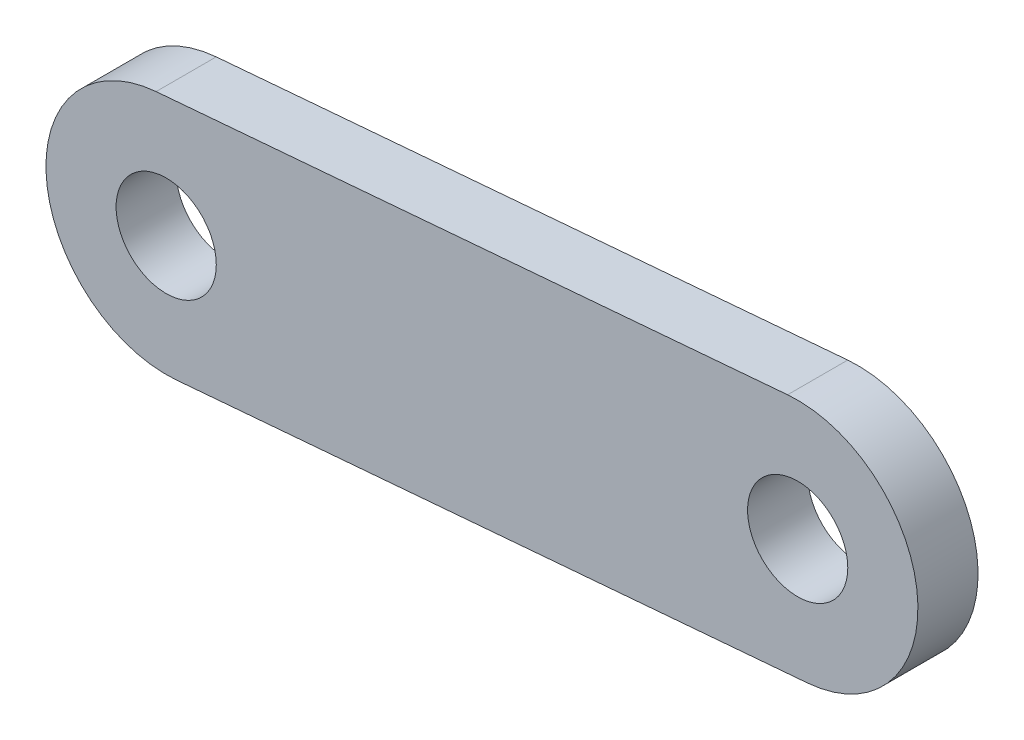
ISO-10303-21;
HEADER;
FILE_DESCRIPTION(('STEP AP214'),'2;1');
FILE_NAME('part.step','',(''),(''),'','','');
FILE_SCHEMA(('AUTOMOTIVE_DESIGN { 1 0 10303 214 1 1 1 1 }'));
ENDSEC;
DATA;
#1=APPLICATION_CONTEXT('core data for automotive mechanical design processes');
#2=APPLICATION_PROTOCOL_DEFINITION('international standard','automotive_design',2000,#1);
#3=PRODUCT_CONTEXT('',#1,'mechanical');
#4=PRODUCT('Part','Part','',(#3));
#5=PRODUCT_RELATED_PRODUCT_CATEGORY('part','',(#4));
#6=PRODUCT_DEFINITION_FORMATION('','',#4);
#7=PRODUCT_DEFINITION_CONTEXT('part definition',#1,'design');
#8=PRODUCT_DEFINITION('design','',#6,#7);
#9=PRODUCT_DEFINITION_SHAPE('','',#8);
#10=(LENGTH_UNIT() NAMED_UNIT(*) SI_UNIT(.MILLI.,.METRE.));
#11=(NAMED_UNIT(*) PLANE_ANGLE_UNIT() SI_UNIT($,.RADIAN.));
#12=(NAMED_UNIT(*) SI_UNIT($,.STERADIAN.) SOLID_ANGLE_UNIT());
#13=UNCERTAINTY_MEASURE_WITH_UNIT(LENGTH_MEASURE(1.E-05),#10,'distance_accuracy_value','');
#14=(GEOMETRIC_REPRESENTATION_CONTEXT(3) GLOBAL_UNCERTAINTY_ASSIGNED_CONTEXT((#13)) GLOBAL_UNIT_ASSIGNED_CONTEXT((#10,
#11,#12)) REPRESENTATION_CONTEXT('',''));
#15=CARTESIAN_POINT('',(0.,0.,0.));
#16=DIRECTION('',(0.,0.,1.));
#17=DIRECTION('',(1.,0.,0.));
#18=AXIS2_PLACEMENT_3D('',#15,#16,#17);
#19=CARTESIAN_POINT('',(-15.7012006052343,-2.65409804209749,1.5));
#20=DIRECTION('',(0.,0.,-1.));
#21=DIRECTION('',(-1.,0.,0.));
#22=AXIS2_PLACEMENT_3D('',#19,#20,#21);
#23=PLANE('',#22);
#24=CARTESIAN_POINT('',(-15.7012006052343,-2.65409804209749,1.5));
#25=DIRECTION('',(0.,0.,1.));
#26=DIRECTION('',(-1.,0.,0.));
#27=AXIS2_PLACEMENT_3D('',#24,#25,#26);
#28=CIRCLE('',#27,6.);
#29=CARTESIAN_POINT('',(-16.2047803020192,3.32473190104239,1.5));
#30=VERTEX_POINT('',#29);
#31=CARTESIAN_POINT('',(-15.1976209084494,-8.63292798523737,1.5));
#32=VERTEX_POINT('',#31);
#33=EDGE_CURVE('E86',#30,#32,#28,.T.);
#34=ORIENTED_EDGE('',*,*,#33,.T.);
#35=DIRECTION('',(0.99647165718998,0.0839299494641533,0.));
#36=VECTOR('',#35,1.);
#37=CARTESIAN_POINT('',(-15.1976209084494,-8.63292798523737,1.5));
#38=LINE('',#37,#36);
#39=CARTESIAN_POINT('',(16.3135796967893,-5.97882994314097,1.5));
#40=VERTEX_POINT('',#39);
#41=EDGE_CURVE('E81',#32,#40,#38,.T.);
#42=ORIENTED_EDGE('',*,*,#41,.T.);
#43=CARTESIAN_POINT('',(15.8100000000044,-1.08940634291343E-12,1.5));
#44=DIRECTION('',(0.,0.,1.));
#45=DIRECTION('',(1.,0.,0.));
#46=AXIS2_PLACEMENT_3D('',#43,#44,#45);
#47=CIRCLE('',#46,6.);
#48=CARTESIAN_POINT('',(15.3064203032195,5.97882994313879,1.5));
#49=VERTEX_POINT('',#48);
#50=EDGE_CURVE('E84',#40,#49,#47,.T.);
#51=ORIENTED_EDGE('',*,*,#50,.T.);
#52=DIRECTION('',(-0.99647165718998,-0.0839299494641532,0.));
#53=VECTOR('',#52,1.);
#54=CARTESIAN_POINT('',(15.3064203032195,5.97882994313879,1.5));
#55=LINE('',#54,#53);
#56=EDGE_CURVE('E51',#49,#30,#55,.T.);
#57=ORIENTED_EDGE('',*,*,#56,.T.);
#58=EDGE_LOOP('',(#34,#42,#51,#57));
#59=FACE_BOUND('',#58,.T.);
#60=CARTESIAN_POINT('',(15.8100000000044,-1.08940634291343E-12,1.5));
#61=DIRECTION('',(0.,0.,1.));
#62=DIRECTION('',(1.,0.,0.));
#63=AXIS2_PLACEMENT_3D('',#60,#61,#62);
#64=CIRCLE('',#63,2.5);
#65=CARTESIAN_POINT('',(18.3100000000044,-1.08940634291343E-12,1.5));
#66=VERTEX_POINT('',#65);
#67=EDGE_CURVE('E101',#66,#66,#64,.T.);
#68=ORIENTED_EDGE('',*,*,#67,.F.);
#69=EDGE_LOOP('',(#68));
#70=FACE_BOUND('',#69,.T.);
#71=CARTESIAN_POINT('',(-15.7012006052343,-2.65409804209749,1.5));
#72=DIRECTION('',(0.,0.,1.));
#73=DIRECTION('',(1.,0.,0.));
#74=AXIS2_PLACEMENT_3D('',#71,#72,#73);
#75=CIRCLE('',#74,2.5);
#76=CARTESIAN_POINT('',(-13.2012006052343,-2.65409804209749,1.5));
#77=VERTEX_POINT('',#76);
#78=EDGE_CURVE('E116',#77,#77,#75,.T.);
#79=ORIENTED_EDGE('',*,*,#78,.F.);
#80=EDGE_LOOP('',(#79));
#81=FACE_BOUND('',#80,.T.);
#82=ADVANCED_FACE('F34',(#59,#70,#81),#23,.F.);
#83=CARTESIAN_POINT('',(-15.7012006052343,-2.65409804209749,-1.5));
#84=DIRECTION('',(0.,0.,-1.));
#85=DIRECTION('',(-1.,0.,0.));
#86=AXIS2_PLACEMENT_3D('',#83,#84,#85);
#87=PLANE('',#86);
#88=CARTESIAN_POINT('',(15.8100000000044,-1.08940634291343E-12,-1.5));
#89=DIRECTION('',(0.,0.,1.));
#90=DIRECTION('',(1.,0.,0.));
#91=AXIS2_PLACEMENT_3D('',#88,#89,#90);
#92=CIRCLE('',#91,2.5);
#93=CARTESIAN_POINT('',(18.3100000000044,-1.08940634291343E-12,-1.5));
#94=VERTEX_POINT('',#93);
#95=EDGE_CURVE('E113',#94,#94,#92,.T.);
#96=ORIENTED_EDGE('',*,*,#95,.T.);
#97=EDGE_LOOP('',(#96));
#98=FACE_BOUND('',#97,.T.);
#99=CARTESIAN_POINT('',(-15.7012006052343,-2.65409804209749,-1.5));
#100=DIRECTION('',(0.,0.,1.));
#101=DIRECTION('',(-1.,0.,0.));
#102=AXIS2_PLACEMENT_3D('',#99,#100,#101);
#103=CIRCLE('',#102,6.);
#104=CARTESIAN_POINT('',(-16.2047803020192,3.32473190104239,-1.5));
#105=VERTEX_POINT('',#104);
#106=CARTESIAN_POINT('',(-15.1976209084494,-8.63292798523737,-1.5));
#107=VERTEX_POINT('',#106);
#108=EDGE_CURVE('E98',#105,#107,#103,.T.);
#109=ORIENTED_EDGE('',*,*,#108,.F.);
#110=DIRECTION('',(-0.99647165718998,-0.0839299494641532,0.));
#111=VECTOR('',#110,1.);
#112=CARTESIAN_POINT('',(15.3064203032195,5.97882994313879,-1.5));
#113=LINE('',#112,#111);
#114=CARTESIAN_POINT('',(15.3064203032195,5.97882994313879,-1.5));
#115=VERTEX_POINT('',#114);
#116=EDGE_CURVE('E74',#115,#105,#113,.T.);
#117=ORIENTED_EDGE('',*,*,#116,.F.);
#118=CARTESIAN_POINT('',(15.8100000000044,-1.08940634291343E-12,-1.5));
#119=DIRECTION('',(0.,0.,1.));
#120=DIRECTION('',(1.,0.,0.));
#121=AXIS2_PLACEMENT_3D('',#118,#119,#120);
#122=CIRCLE('',#121,6.);
#123=CARTESIAN_POINT('',(16.3135796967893,-5.97882994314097,-1.5));
#124=VERTEX_POINT('',#123);
#125=EDGE_CURVE('E68',#124,#115,#122,.T.);
#126=ORIENTED_EDGE('',*,*,#125,.F.);
#127=DIRECTION('',(0.99647165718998,0.0839299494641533,0.));
#128=VECTOR('',#127,1.);
#129=CARTESIAN_POINT('',(-15.1976209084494,-8.63292798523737,-1.5));
#130=LINE('',#129,#128);
#131=EDGE_CURVE('E90',#107,#124,#130,.T.);
#132=ORIENTED_EDGE('',*,*,#131,.F.);
#133=EDGE_LOOP('',(#109,#117,#126,#132));
#134=FACE_BOUND('',#133,.T.);
#135=CARTESIAN_POINT('',(-15.7012006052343,-2.65409804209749,-1.5));
#136=DIRECTION('',(0.,0.,1.));
#137=DIRECTION('',(1.,0.,0.));
#138=AXIS2_PLACEMENT_3D('',#135,#136,#137);
#139=CIRCLE('',#138,2.5);
#140=CARTESIAN_POINT('',(-13.2012006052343,-2.65409804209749,-1.5));
#141=VERTEX_POINT('',#140);
#142=EDGE_CURVE('E119',#141,#141,#139,.T.);
#143=ORIENTED_EDGE('',*,*,#142,.T.);
#144=EDGE_LOOP('',(#143));
#145=FACE_BOUND('',#144,.T.);
#146=ADVANCED_FACE('F109',(#98,#134,#145),#87,.T.);
#147=CARTESIAN_POINT('',(-15.7012006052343,-2.65409804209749,1.5));
#148=DIRECTION('',(0.,0.,-1.));
#149=DIRECTION('',(-1.,0.,0.));
#150=AXIS2_PLACEMENT_3D('',#147,#148,#149);
#151=CYLINDRICAL_SURFACE('',#150,6.);
#152=ORIENTED_EDGE('',*,*,#108,.T.);
#153=DIRECTION('',(0.,0.,-1.));
#154=VECTOR('',#153,1.);
#155=CARTESIAN_POINT('',(-15.1976209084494,-8.63292798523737,1.5));
#156=LINE('',#155,#154);
#157=EDGE_CURVE('E11',#32,#107,#156,.T.);
#158=ORIENTED_EDGE('',*,*,#157,.F.);
#159=ORIENTED_EDGE('',*,*,#33,.F.);
#160=DIRECTION('',(0.,0.,-1.));
#161=VECTOR('',#160,1.);
#162=CARTESIAN_POINT('',(-16.2047803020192,3.32473190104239,1.5));
#163=LINE('',#162,#161);
#164=EDGE_CURVE('E94',#30,#105,#163,.T.);
#165=ORIENTED_EDGE('',*,*,#164,.T.);
#166=EDGE_LOOP('',(#152,#158,#159,#165));
#167=FACE_BOUND('',#166,.T.);
#168=ADVANCED_FACE('F36',(#167),#151,.T.);
#169=CARTESIAN_POINT('',(-15.1976209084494,-8.63292798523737,1.5));
#170=DIRECTION('',(-0.0839299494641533,0.99647165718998,0.));
#171=DIRECTION('',(-0.99647165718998,-0.0839299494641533,0.));
#172=AXIS2_PLACEMENT_3D('',#169,#170,#171);
#173=PLANE('',#172);
#174=ORIENTED_EDGE('',*,*,#131,.T.);
#175=DIRECTION('',(0.,0.,-1.));
#176=VECTOR('',#175,1.);
#177=CARTESIAN_POINT('',(16.3135796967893,-5.97882994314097,1.5));
#178=LINE('',#177,#176);
#179=EDGE_CURVE('E43',#40,#124,#178,.T.);
#180=ORIENTED_EDGE('',*,*,#179,.F.);
#181=ORIENTED_EDGE('',*,*,#41,.F.);
#182=ORIENTED_EDGE('',*,*,#157,.T.);
#183=EDGE_LOOP('',(#174,#180,#181,#182));
#184=FACE_BOUND('',#183,.T.);
#185=ADVANCED_FACE('F89',(#184),#173,.F.);
#186=CARTESIAN_POINT('',(15.8100000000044,-1.08940634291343E-12,1.5));
#187=DIRECTION('',(0.,0.,-1.));
#188=DIRECTION('',(-1.,0.,0.));
#189=AXIS2_PLACEMENT_3D('',#186,#187,#188);
#190=CYLINDRICAL_SURFACE('',#189,6.);
#191=ORIENTED_EDGE('',*,*,#125,.T.);
#192=DIRECTION('',(0.,0.,-1.));
#193=VECTOR('',#192,1.);
#194=CARTESIAN_POINT('',(15.3064203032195,5.97882994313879,1.5));
#195=LINE('',#194,#193);
#196=EDGE_CURVE('E91',#49,#115,#195,.T.);
#197=ORIENTED_EDGE('',*,*,#196,.F.);
#198=ORIENTED_EDGE('',*,*,#50,.F.);
#199=ORIENTED_EDGE('',*,*,#179,.T.);
#200=EDGE_LOOP('',(#191,#197,#198,#199));
#201=FACE_BOUND('',#200,.T.);
#202=ADVANCED_FACE('F92',(#201),#190,.T.);
#203=CARTESIAN_POINT('',(15.3064203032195,5.97882994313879,1.5));
#204=DIRECTION('',(0.0839299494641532,-0.99647165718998,0.));
#205=DIRECTION('',(0.99647165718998,0.0839299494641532,0.));
#206=AXIS2_PLACEMENT_3D('',#203,#204,#205);
#207=PLANE('',#206);
#208=ORIENTED_EDGE('',*,*,#116,.T.);
#209=ORIENTED_EDGE('',*,*,#164,.F.);
#210=ORIENTED_EDGE('',*,*,#56,.F.);
#211=ORIENTED_EDGE('',*,*,#196,.T.);
#212=EDGE_LOOP('',(#208,#209,#210,#211));
#213=FACE_BOUND('',#212,.T.);
#214=ADVANCED_FACE('F106',(#213),#207,.F.);
#215=CARTESIAN_POINT('',(15.8100000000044,-1.08940634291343E-12,1.5));
#216=DIRECTION('',(0.,0.,-1.));
#217=DIRECTION('',(-1.,0.,0.));
#218=AXIS2_PLACEMENT_3D('',#215,#216,#217);
#219=CYLINDRICAL_SURFACE('',#218,2.5);
#220=ORIENTED_EDGE('',*,*,#67,.T.);
#221=EDGE_LOOP('',(#220));
#222=FACE_BOUND('',#221,.T.);
#223=ORIENTED_EDGE('',*,*,#95,.F.);
#224=EDGE_LOOP('',(#223));
#225=FACE_BOUND('',#224,.T.);
#226=ADVANCED_FACE('F136',(#222,#225),#219,.F.);
#227=CARTESIAN_POINT('',(-15.7012006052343,-2.65409804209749,1.5));
#228=DIRECTION('',(0.,0.,-1.));
#229=DIRECTION('',(-1.,0.,0.));
#230=AXIS2_PLACEMENT_3D('',#227,#228,#229);
#231=CYLINDRICAL_SURFACE('',#230,2.5);
#232=ORIENTED_EDGE('',*,*,#78,.T.);
#233=EDGE_LOOP('',(#232));
#234=FACE_BOUND('',#233,.T.);
#235=ORIENTED_EDGE('',*,*,#142,.F.);
#236=EDGE_LOOP('',(#235));
#237=FACE_BOUND('',#236,.T.);
#238=ADVANCED_FACE('F125',(#234,#237),#231,.F.);
#239=CLOSED_SHELL('',(#82,#146,#168,#185,#202,#214,#226,#238));
#240=MANIFOLD_SOLID_BREP('B2',#239);
#241=ADVANCED_BREP_SHAPE_REPRESENTATION('',(#18,#240),#14);
#242=SHAPE_DEFINITION_REPRESENTATION(#9,#241);
ENDSEC;
END-ISO-10303-21;
